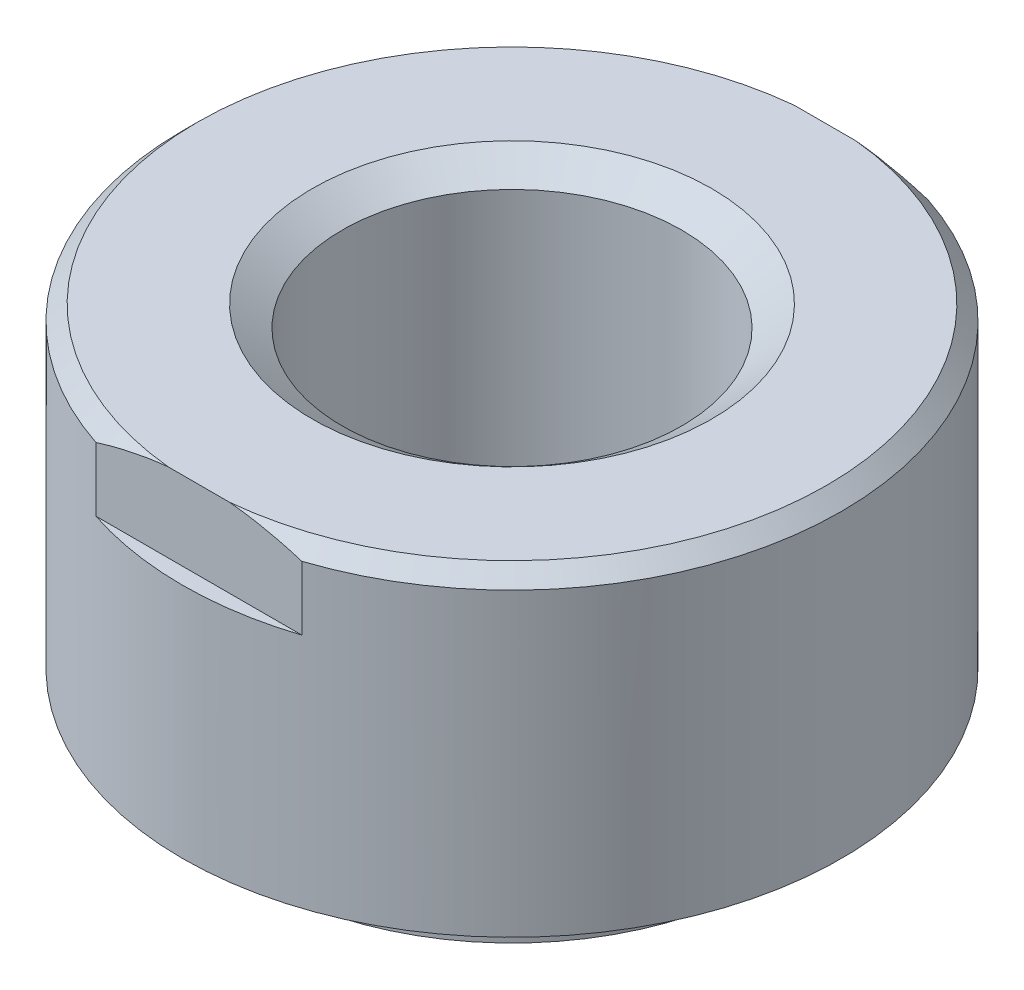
from build123d import *

# Parameters (mm, degrees)
CHAMFER_2_SIZE        = 0.375
FLATSSKE_W            = 16.5
FLATSSKE_H            = 0.825
FLATS_DEPTH           = 1.975
CLICUTSKE_R           = 0.825
CLINCHINGCUT_DEPTH    = 0.592
CLINCHINGCUTPAT_COUNT = 24
CLINCHINGCUTPAT_ANGLE = 345


with BuildPart() as part:
    # BodySke → Body (revolve)
    with BuildSketch(Plane.XY, mode=Mode.PRIVATE) as body_sk:
        Polygon((5.895636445, 0), (6.335, 0), (6.335, -0.592), (7.2925, -0.592), (7.2925, 0), (8.25, 0), (8.25, 7.9), (4.25, 7.9), (4.25, -1.48), (6.335, -1.48), (6.335, -1.353), (5.895636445, -0.592), align=None)
    revolve(body_sk.sketch.rotate(Axis((0, 0, 0), (0, 1, 0)), 90), axis=Axis((0, 0, 0), (0, 1, 0)))

    # Chamfer 2
    chamfer_2_edges = [part.edges().sort_by_distance(p)[0] for p in [
        (0, 7.9, 8.25),
    ]]
    chamfer(chamfer_2_edges, length=CHAMFER_2_SIZE)

    # FlatsSke → Flats (cut)
    with BuildSketch(Plane(origin=(0, 7.9, 0), x_dir=(-1, 0, 0), z_dir=(0, 1, 0))):
        with Locations((0, 8.25)):
            Rectangle(FLATSSKE_W, FLATSSKE_H)
        with Locations((0, -8.25)):
            Rectangle(FLATSSKE_W, FLATSSKE_H)
    extrude(amount=-FLATS_DEPTH, mode=Mode.SUBTRACT)

    # EndChamferSke → EndChamfer (revolve, cut)
    with BuildSketch(Plane.XY, mode=Mode.PRIVATE) as endchamfer_sk:
        Polygon((5, -1.734), (5, -1.47746), (4.25, -0.952499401), (4.25, -1.734), align=None)
        Polygon((5, 7.9), (4.25, 7.375039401), (4.25, 7.9), align=None)
    revolve(endchamfer_sk.sketch.rotate(Axis((0, -2.54, 0), (0, 1, 0)), 90), axis=Axis((0, -2.54, 0), (0, 1, 0)), mode=Mode.SUBTRACT)

    # CliCutSke → ClinchingCut (cut)
    with BuildSketch(Plane.XZ.offset(0.592)):
        with Locations((0.951862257, 7.230111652)):
            Circle(CLICUTSKE_R)
    clinchingcut = extrude(amount=-CLINCHINGCUT_DEPTH, mode=Mode.SUBTRACT)

    # ClinchingCutPat: ClinchingCut ×24 about axis
    clinchingcutpat_axis = Axis((0, 0, 0), (0, 1, 0))
    for i in range(1, CLINCHINGCUTPAT_COUNT):
        add(clinchingcut.rotate(clinchingcutpat_axis, i * CLINCHINGCUTPAT_ANGLE / (CLINCHINGCUTPAT_COUNT - 1)), mode=Mode.SUBTRACT)


solid = part.part
